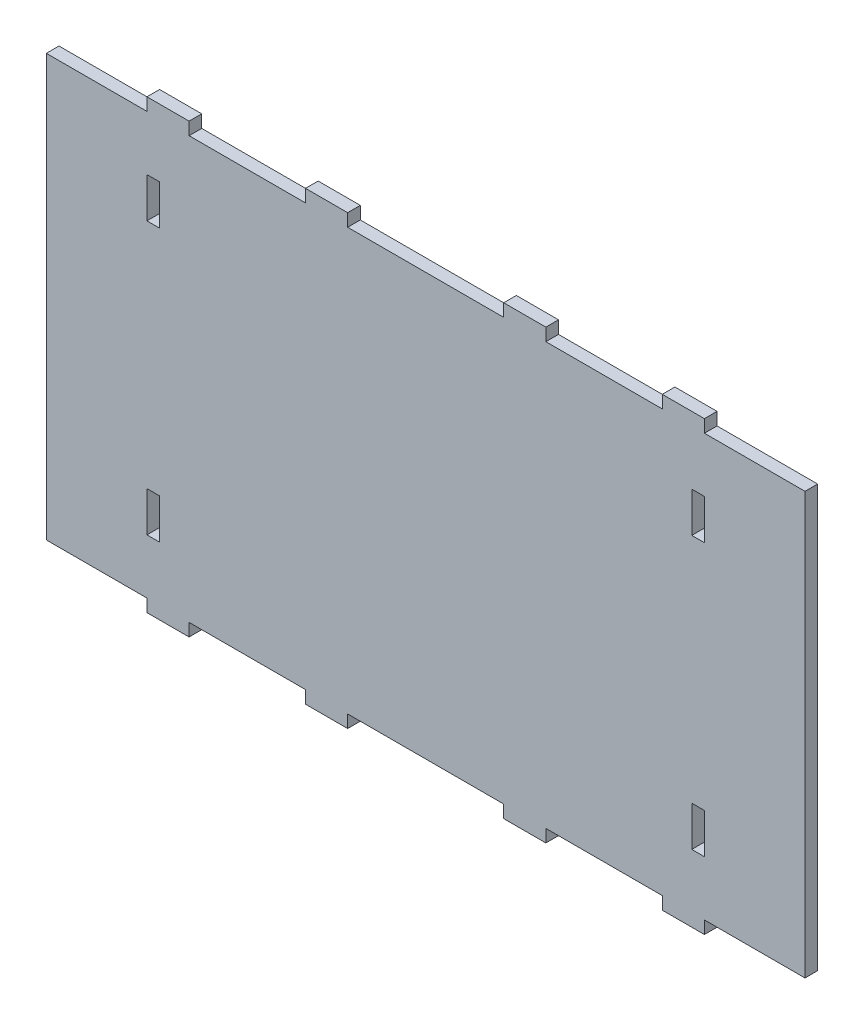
from build123d import *

# Parameters (mm, degrees)
BOSS_EXTRU_1_DEPTH      = 3
ESQUISSE2_W             = 3
ESQUISSE2_H             = 9.506842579
ENL_V_MAT_EXTRU_1_DEPTH = 3


with BuildPart() as part:
    # Esquisse1 → Boss.-Extru.1 (new body)
    with BuildSketch(Plane.XY):
        Polygon((-90, 0), (-66.130511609, 0), (-66.130511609, -3), (-56.130511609, -3), (-56.130511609, 0), (-28.511151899, 0), (-28.511151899, -3), (-18.511151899, -3), (-18.511151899, 0), (18.511151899, 0), (18.511151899, -3), (28.511151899, -3), (28.511151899, 0), (56.130511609, 0), (56.130511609, -3), (66.130511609, -3), (66.130511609, 0), (90, 0), (90, 100), (66.130511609, 100), (66.130511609, 103), (56.130511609, 103), (56.130511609, 100), (28.511151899, 100), (28.511151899, 103), (18.511151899, 103), (18.511151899, 100), (-18.511151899, 100), (-18.511151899, 103), (-28.511151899, 103), (-28.511151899, 100), (-56.130511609, 100), (-56.130511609, 103), (-66.130511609, 103), (-66.130511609, 100), (-90, 100), align=None)
    extrude(amount=BOSS_EXTRU_1_DEPTH)

    # Esquisse2 → Enl_v. mat.-Extru.1 (cut)
    with BuildSketch(Plane.XY.offset(3)):
        with Locations((64.630511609, 17.739426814)):
            Rectangle(ESQUISSE2_W, ESQUISSE2_H)
        with Locations((-64.630511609, 17.739426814)):
            Rectangle(ESQUISSE2_W, ESQUISSE2_H)
        with Locations((64.630511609, 82.260573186)):
            Rectangle(ESQUISSE2_W, ESQUISSE2_H)
        with Locations((-64.630511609, 82.260573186)):
            Rectangle(ESQUISSE2_W, ESQUISSE2_H)
    extrude(amount=-ENL_V_MAT_EXTRU_1_DEPTH, mode=Mode.SUBTRACT)


solid = part.part
